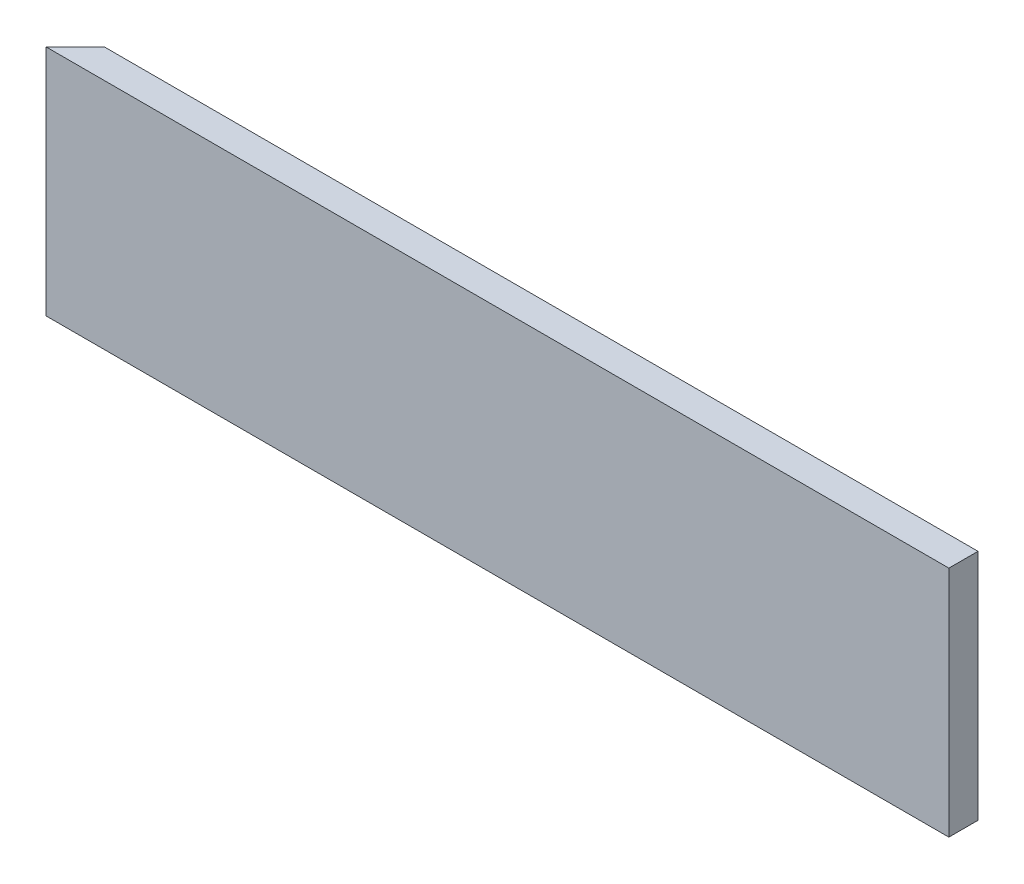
from build123d import *

# Parameters (mm, degrees)
BOSS_EXTRUDE1_DEPTH = 203.2


with BuildPart() as part:
    # Sketch2 → Boss-Extrude1 (new body)
    with BuildSketch(Plane(origin=(0, 0, 0), x_dir=(1, 0, 0), z_dir=(0, 1, 0))):
        Polygon((0, 0), (0, -25.4), (-787.4, -25.4), (-762, 0), align=None)
    extrude(amount=BOSS_EXTRUDE1_DEPTH)


solid = part.part
